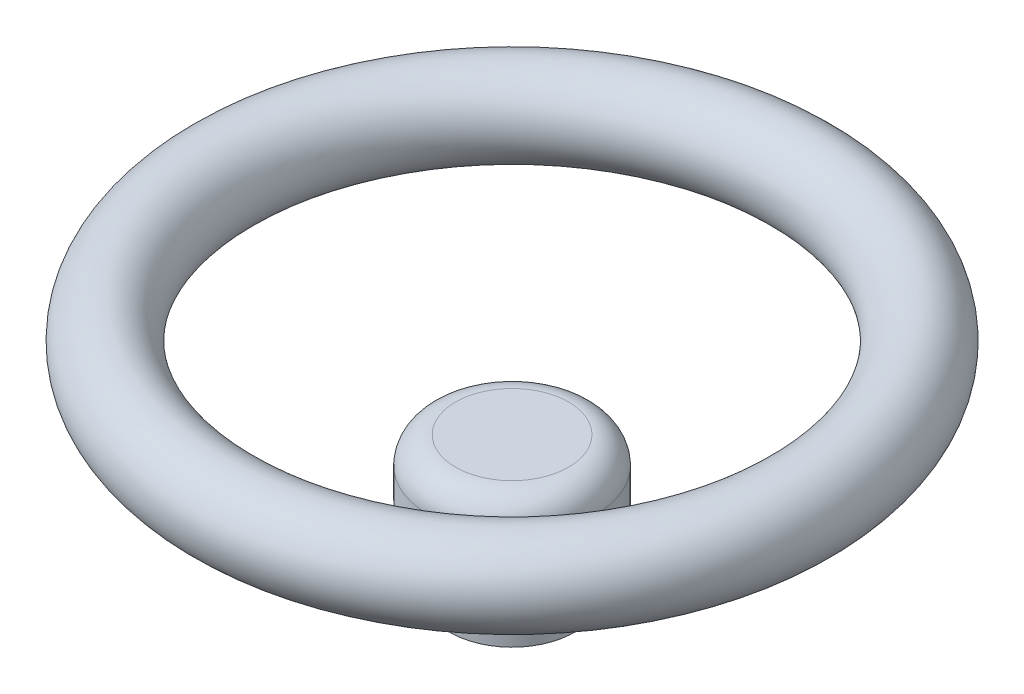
from build123d import *

# Parameters (mm, degrees)
SKETCH1_R = 8.734980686


with BuildPart() as part:
    # Sketch1 → Revolve1 (revolve)
    with BuildSketch(Plane.XY, mode=Mode.PRIVATE) as revolve1_sk:
        with Locations((60.445848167, 17.075098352)):
            Circle(SKETCH1_R)
        with BuildLine():
            Line((0, 0), (11.862125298, 0))
            ThreePointArc((11.862125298, 0), (15.908862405, -1.676213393), (17.585075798, -5.7229505))
            Line((17.585075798, -5.7229505), (17.585075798, -12.382969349))
            Line((17.585075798, -12.382969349), (13.062097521, -12.382969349))
            Line((13.062097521, -12.382969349), (13.062097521, -29.427049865))
            Line((13.062097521, -29.427049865), (0, -29.427049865))
            Line((0, -29.427049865), (0, 0))
        make_face()
    revolve(revolve1_sk.sketch.rotate(Axis((0, 0, 0), (0, -1, 0)), 180), axis=Axis((0, 0, 0), (0, -1, 0)))


solid = part.part
